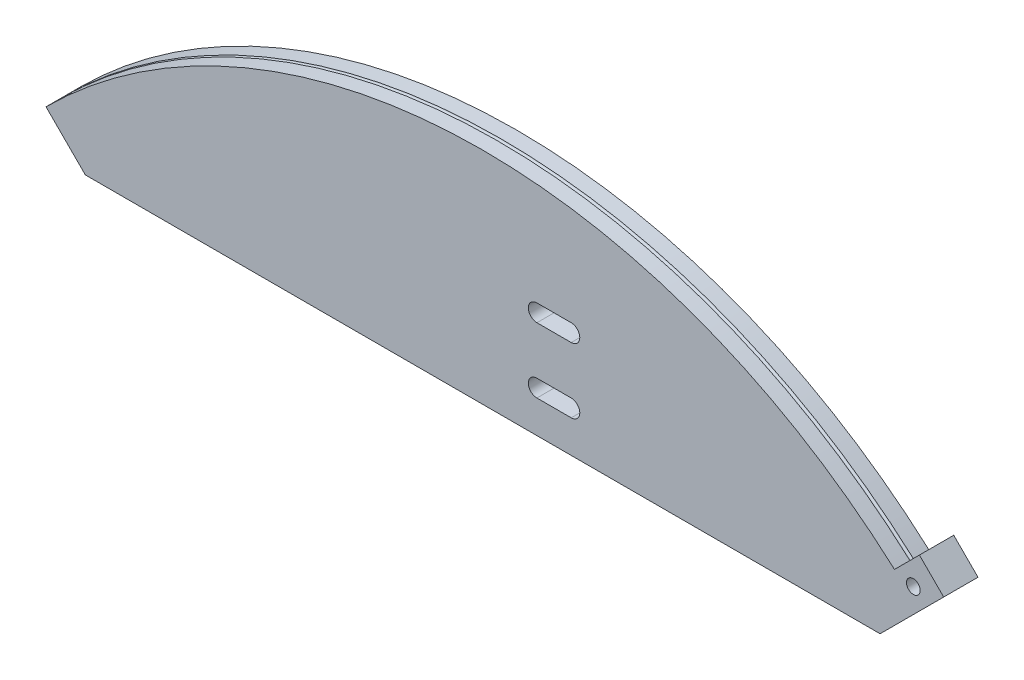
from build123d import *

# Parameters (mm, degrees)
BOSS_EXTRU_1_DEPTH           = 5
BOSS_EXTRU_2_DEPTH           = 5
BOSS_EXTRU_2_DEPTH_BACK      = 5
BOSS_EXTRU_3_DEPTH           = 5
BOSS_EXTRU_3_DEPTH_BACK      = 5
ESQUISSE7_R                  = 2
ENL_V_MAT_EXTRU_4_DEPTH      = 225.666419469
ENL_V_MAT_EXTRU_4_DEPTH_BACK = 225.666419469
ENL_V_MAT_EXTRU_6_DEPTH      = 225.666419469
ENL_V_MAT_EXTRU_6_DEPTH_BACK = 225.666419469


with BuildPart() as part:
    # Esquisse1 → Boss.-Extru.1 (new body)
    with BuildSketch(Plane.XY):
        with BuildLine():
            Line((-120.208152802, 115.814760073), (120.208152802, 115.814760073))
            Line((120.208152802, 115.814760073), (120.208152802, 120.208152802))
            ThreePointArc((120.208152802, 120.208152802), (0, 170), (-120.208152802, 120.208152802))
            Line((-120.208152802, 120.208152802), (-120.208152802, 115.814760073))
        make_face()
    extrude(amount=BOSS_EXTRU_1_DEPTH)

    # Esquisse2 → Boss.-Extru.2 (add, two sides: drawn at the far end of the back side and taken through both)
    with BuildSketch(Plane(origin=(0, 0, 0), x_dir=(-1, 0, 0), z_dir=(0, 0, -1)).offset(-BOSS_EXTRU_2_DEPTH_BACK)):
        with BuildLine():
            Line((127.279220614, 127.279220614), (120.208152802, 120.208152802))
            ThreePointArc((120.208152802, 120.208152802), (0, 170), (-120.208152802, 120.208152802))
            Line((-120.208152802, 120.208152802), (-127.279220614, 127.279220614))
            ThreePointArc((-127.279220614, 127.279220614), (0, 180), (127.279220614, 127.279220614))
        make_face()
    extrude(amount=BOSS_EXTRU_2_DEPTH + BOSS_EXTRU_2_DEPTH_BACK)

    # Enl_vement de mati_re-Balayage1: sweep along a path in Esquisse3
    with BuildLine(Plane(origin=(0, 0, 0), x_dir=(-1, 0, 0), z_dir=(0, 0, -1))) as enl_vement_de_mati_re_balayage1_path:
        ThreePointArc((126.572113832, 126.572113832), (0, 179), (-126.572113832, 126.572113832))
    # Esquisse5 → Enl_vement de mati_re-Balayage1 (sweep, cut)
    with BuildSketch(Plane(origin=(0, 0, 0), x_dir=(0, 0, -1), z_dir=(0.7071067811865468, -0.7071067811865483, 0))):
        with BuildLine():
            Line((-0.5, 180), (0.5, 180))
            ThreePointArc((0.5, 180), (0, 179.5), (-0.5, 180))
        make_face()
    sweep(path=enl_vement_de_mati_re_balayage1_path.line, mode=Mode.SUBTRACT)

    # Esquisse7 → Boss.-Extru.3 (add, two sides: drawn at the far end of the back side and taken through both)
    with BuildSketch(Plane(origin=(0, 0, 0), x_dir=(-1, 0, 0), z_dir=(0, 0, -1)).offset(-BOSS_EXTRU_3_DEPTH_BACK)):
        Polygon((-123.743686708, 123.743686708), (-134.350288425, 134.350288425), (-127.279220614, 141.421356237), (-116.672618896, 130.81475452), align=None)
        with Locations((-125.511453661, 132.582521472)):
            Circle(ESQUISSE7_R, mode=Mode.SUBTRACT)
    extrude(amount=BOSS_EXTRU_3_DEPTH + BOSS_EXTRU_3_DEPTH_BACK)

    # Esquisse8 → Enl_v. mat.-Extru.4 (cut, two sides: drawn at the far end of the back side and taken through both)
    with BuildSketch(Plane(origin=(0, 0, 0), x_dir=(-1, 0, 0), z_dir=(0, 0, -1)).offset(-ENL_V_MAT_EXTRU_4_DEPTH_BACK)):
        Polygon((-120.208152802, 120.208152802), (-104.630387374, 104.630387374), (-145.023097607, 109.535343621), (-125.124551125, 125.124551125), align=None)
        Polygon((127.279220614, 127.279220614), (100.741517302, 100.741517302), (140.507843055, 93.246561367), align=None)
    extrude(amount=ENL_V_MAT_EXTRU_4_DEPTH + ENL_V_MAT_EXTRU_4_DEPTH_BACK, mode=Mode.SUBTRACT)

    # Esquisse10 → Enl_v. mat.-Extru.6 (cut, two sides: drawn at the far end of the back side and taken through both)
    with BuildSketch(Plane(origin=(0, 0, 0), x_dir=(-1, 0, 0), z_dir=(0, 0, -1)).offset(-ENL_V_MAT_EXTRU_6_DEPTH_BACK)):
        with BuildLine():
            Line((-25.791169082, 149.314760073), (-15.791169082, 149.314760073))
            ThreePointArc((-15.791169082, 149.314760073), (-13.291169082, 146.814760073), (-15.791169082, 144.314760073))
            Line((-15.791169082, 144.314760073), (-25.791169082, 144.314760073))
            ThreePointArc((-25.791169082, 144.314760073), (-28.291169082, 146.814760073), (-25.791169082, 149.314760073))
        make_face()
        with BuildLine():
            Line((-25.791169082, 130.314760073), (-15.791169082, 130.314760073))
            ThreePointArc((-15.791169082, 130.314760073), (-13.291169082, 127.814760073), (-15.791169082, 125.314760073))
            Line((-15.791169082, 125.314760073), (-25.791169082, 125.314760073))
            ThreePointArc((-25.791169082, 125.314760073), (-28.291169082, 127.814760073), (-25.791169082, 130.314760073))
        make_face()
    extrude(amount=ENL_V_MAT_EXTRU_6_DEPTH + ENL_V_MAT_EXTRU_6_DEPTH_BACK, mode=Mode.SUBTRACT)


solid = part.part
